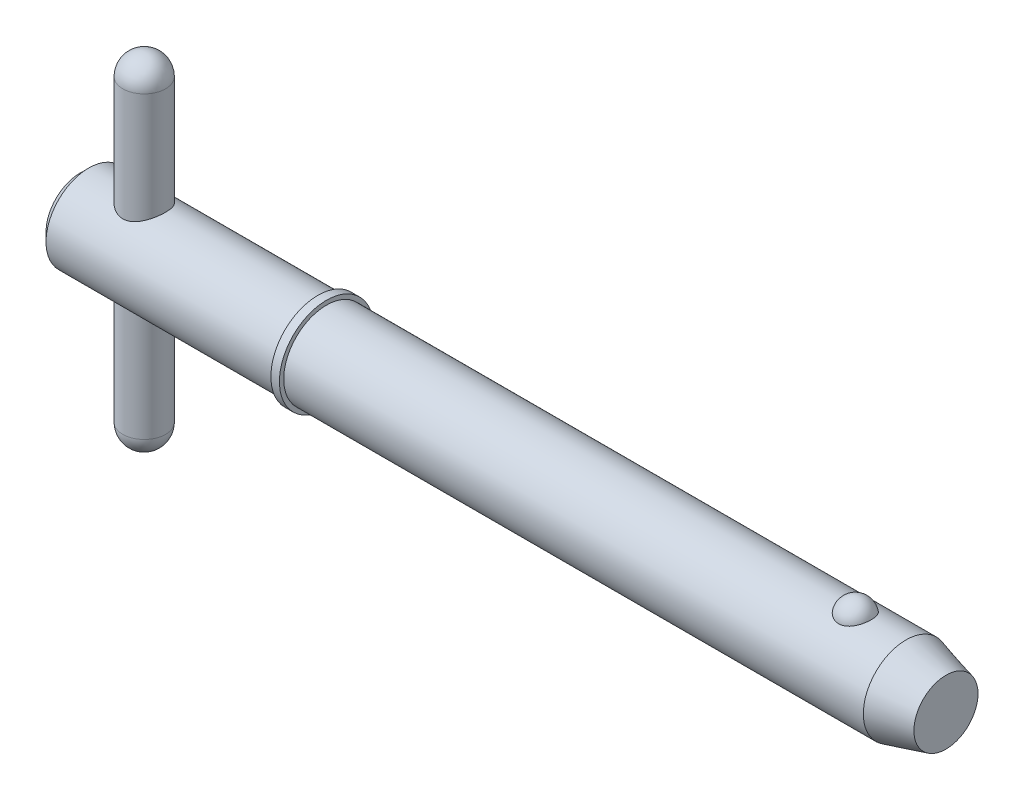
ISO-10303-21;
HEADER;
FILE_DESCRIPTION(('STEP AP214'),'2;1');
FILE_NAME('part.step','',(''),(''),'','','');
FILE_SCHEMA(('AUTOMOTIVE_DESIGN { 1 0 10303 214 1 1 1 1 }'));
ENDSEC;
DATA;
#1=APPLICATION_CONTEXT('core data for automotive mechanical design processes');
#2=APPLICATION_PROTOCOL_DEFINITION('international standard','automotive_design',2000,#1);
#3=PRODUCT_CONTEXT('',#1,'mechanical');
#4=PRODUCT('Part','Part','',(#3));
#5=PRODUCT_RELATED_PRODUCT_CATEGORY('part','',(#4));
#6=PRODUCT_DEFINITION_FORMATION('','',#4);
#7=PRODUCT_DEFINITION_CONTEXT('part definition',#1,'design');
#8=PRODUCT_DEFINITION('design','',#6,#7);
#9=PRODUCT_DEFINITION_SHAPE('','',#8);
#10=(LENGTH_UNIT() NAMED_UNIT(*) SI_UNIT(.MILLI.,.METRE.));
#11=(NAMED_UNIT(*) PLANE_ANGLE_UNIT() SI_UNIT($,.RADIAN.));
#12=(NAMED_UNIT(*) SI_UNIT($,.STERADIAN.) SOLID_ANGLE_UNIT());
#13=UNCERTAINTY_MEASURE_WITH_UNIT(LENGTH_MEASURE(1.E-05),#10,'distance_accuracy_value','');
#14=(GEOMETRIC_REPRESENTATION_CONTEXT(3) GLOBAL_UNCERTAINTY_ASSIGNED_CONTEXT((#13)) GLOBAL_UNIT_ASSIGNED_CONTEXT((#10,
#11,#12)) REPRESENTATION_CONTEXT('',''));
#15=CARTESIAN_POINT('',(0.,0.,0.));
#16=DIRECTION('',(0.,0.,1.));
#17=DIRECTION('',(1.,0.,0.));
#18=AXIS2_PLACEMENT_3D('',#15,#16,#17);
#19=CARTESIAN_POINT('',(4.755,12.7,0.));
#20=DIRECTION('',(0.,-1.,0.));
#21=DIRECTION('',(0.,0.,-1.));
#22=AXIS2_PLACEMENT_3D('',#19,#20,#21);
#23=CYLINDRICAL_SURFACE('',#22,1.585);
#24=CARTESIAN_POINT('',(4.755,-11.115,0.));
#25=DIRECTION('',(0.,-1.,0.));
#26=DIRECTION('',(0.,0.,-1.));
#27=AXIS2_PLACEMENT_3D('',#24,#25,#26);
#28=CIRCLE('',#27,1.585);
#29=CARTESIAN_POINT('',(4.755,-11.115,-1.585));
#30=VERTEX_POINT('',#29);
#31=EDGE_CURVE('P0_E10',#30,#30,#28,.F.);
#32=ORIENTED_EDGE('',*,*,#31,.T.);
#33=EDGE_LOOP('',(#32));
#34=FACE_BOUND('',#33,.T.);
#35=CARTESIAN_POINT('',(4.755,11.115,0.));
#36=DIRECTION('',(0.,-1.,0.));
#37=DIRECTION('',(0.,0.,-1.));
#38=AXIS2_PLACEMENT_3D('',#35,#36,#37);
#39=CIRCLE('',#38,1.585);
#40=CARTESIAN_POINT('',(4.755,11.115,-1.585));
#41=VERTEX_POINT('',#40);
#42=EDGE_CURVE('P0_E21',#41,#41,#39,.T.);
#43=ORIENTED_EDGE('',*,*,#42,.T.);
#44=EDGE_LOOP('',(#43));
#45=FACE_BOUND('',#44,.T.);
#46=ADVANCED_FACE('P0_F14',(#34,#45),#23,.T.);
#47=CARTESIAN_POINT('',(4.755,-11.115,0.));
#48=DIRECTION('',(0.,0.,1.));
#49=DIRECTION('',(1.,0.,0.));
#50=AXIS2_PLACEMENT_3D('',#47,#48,#49);
#51=SPHERICAL_SURFACE('',#50,1.585);
#52=CARTESIAN_POINT('',(4.755,-11.115,0.));
#53=DIRECTION('',(0.,-1.,0.));
#54=DIRECTION('',(0.,0.,-1.));
#55=AXIS2_PLACEMENT_3D('',#52,#53,#54);
#56=SPHERICAL_SURFACE('',#55,1.585);
#57=ORIENTED_EDGE('',*,*,#31,.F.);
#58=EDGE_LOOP('',(#57));
#59=FACE_BOUND('',#58,.T.);
#60=ADVANCED_FACE('P0_F29',(#59),#56,.T.);
#61=CARTESIAN_POINT('',(4.755,11.115,0.));
#62=DIRECTION('',(0.,0.,1.));
#63=DIRECTION('',(1.,0.,0.));
#64=AXIS2_PLACEMENT_3D('',#61,#62,#63);
#65=SPHERICAL_SURFACE('',#64,1.585);
#66=CARTESIAN_POINT('',(4.755,11.115,0.));
#67=DIRECTION('',(0.,-1.,0.));
#68=DIRECTION('',(0.,0.,-1.));
#69=AXIS2_PLACEMENT_3D('',#66,#67,#68);
#70=SPHERICAL_SURFACE('',#69,1.585);
#71=ORIENTED_EDGE('',*,*,#42,.F.);
#72=EDGE_LOOP('',(#71));
#73=FACE_BOUND('',#72,.T.);
#74=ADVANCED_FACE('P0_F16',(#73),#70,.T.);
#75=CLOSED_SHELL('',(#46,#60,#74));
#76=MANIFOLD_SOLID_BREP('P0_B1',#75);
#77=CARTESIAN_POINT('',(0.,0.,0.));
#78=DIRECTION('',(1.,0.,0.));
#79=DIRECTION('',(0.,0.,-1.));
#80=AXIS2_PLACEMENT_3D('',#77,#78,#79);
#81=CYLINDRICAL_SURFACE('',#80,3.175);
#82=CARTESIAN_POINT('',(61.3476846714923,0.,0.));
#83=DIRECTION('',(1.,0.,0.));
#84=DIRECTION('',(0.,0.,-1.));
#85=AXIS2_PLACEMENT_3D('',#82,#83,#84);
#86=CIRCLE('',#85,3.175);
#87=CARTESIAN_POINT('',(61.3476846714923,0.,-3.175));
#88=VERTEX_POINT('',#87);
#89=EDGE_CURVE('P1_E81',#88,#88,#86,.T.);
#90=ORIENTED_EDGE('',*,*,#89,.F.);
#91=EDGE_LOOP('',(#90));
#92=FACE_BOUND('',#91,.T.);
#93=CARTESIAN_POINT('',(18.29,0.,0.));
#94=DIRECTION('',(1.,0.,0.));
#95=DIRECTION('',(0.,0.,-1.));
#96=AXIS2_PLACEMENT_3D('',#93,#94,#95);
#97=CIRCLE('',#96,3.175);
#98=CARTESIAN_POINT('',(18.29,0.,-3.175));
#99=VERTEX_POINT('',#98);
#100=EDGE_CURVE('P1_E85',#99,#99,#97,.T.);
#101=ORIENTED_EDGE('',*,*,#100,.T.);
#102=EDGE_LOOP('',(#101));
#103=FACE_BOUND('',#102,.T.);
#104=CARTESIAN_POINT('',(57.5757276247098,2.92898950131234,1.2254164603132));
#105=CARTESIAN_POINT('',(57.512316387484,2.92899434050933,1.22541146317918));
#106=CARTESIAN_POINT('',(57.4487979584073,2.93112688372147,1.22034641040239));
#107=CARTESIAN_POINT('',(57.3235306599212,2.93942752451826,1.2002094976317));
#108=CARTESIAN_POINT('',(57.2617869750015,2.9456063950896,1.1851109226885));
#109=CARTESIAN_POINT('',(57.1420651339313,2.96127115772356,1.14540352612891));
#110=CARTESIAN_POINT('',(57.0840775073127,2.97074831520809,1.12081980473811));
#111=CARTESIAN_POINT('',(56.9731943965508,2.99197584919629,1.06285154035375));
#112=CARTESIAN_POINT('',(56.9202966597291,3.0037252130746,1.02947091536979));
#113=CARTESIAN_POINT('',(56.8192688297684,3.02865714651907,0.95367409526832));
#114=CARTESIAN_POINT('',(56.771324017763,3.04187163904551,0.911021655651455));
#115=CARTESIAN_POINT('',(56.6830360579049,3.06808741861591,0.818400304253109));
#116=CARTESIAN_POINT('',(56.6426952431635,3.08108863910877,0.768429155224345));
#117=CARTESIAN_POINT('',(56.5688039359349,3.10614903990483,0.660064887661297));
#118=CARTESIAN_POINT('',(56.5356330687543,3.11814104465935,0.601396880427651));
#119=CARTESIAN_POINT('',(56.4791190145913,3.13926931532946,0.47902691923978));
#120=CARTESIAN_POINT('',(56.4557764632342,3.14840539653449,0.415324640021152));
#121=CARTESIAN_POINT('',(56.4191785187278,3.16298160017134,0.283885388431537));
#122=CARTESIAN_POINT('',(56.4060407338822,3.16837855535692,0.21611080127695));
#123=CARTESIAN_POINT('',(56.3905676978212,3.17475386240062,0.0791367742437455));
#124=CARTESIAN_POINT('',(56.388232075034,3.17573236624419,0.00993738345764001));
#125=CARTESIAN_POINT('',(56.3943886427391,3.17318075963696,-0.127420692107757));
#126=CARTESIAN_POINT('',(56.4028073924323,3.16968122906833,-0.195583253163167));
#127=CARTESIAN_POINT('',(56.4301752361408,3.1585790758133,-0.329413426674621));
#128=CARTESIAN_POINT('',(56.4491245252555,3.15097637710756,-0.395080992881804));
#129=CARTESIAN_POINT('',(56.4972057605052,3.13242485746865,-0.522180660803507));
#130=CARTESIAN_POINT('',(56.5263524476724,3.12147119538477,-0.583606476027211));
#131=CARTESIAN_POINT('',(56.5942352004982,3.09734973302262,-0.700436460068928));
#132=CARTESIAN_POINT('',(56.632972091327,3.08418174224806,-0.7558401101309));
#133=CARTESIAN_POINT('',(56.7194771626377,3.05694884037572,-0.859404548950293));
#134=CARTESIAN_POINT('',(56.7672961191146,3.04287919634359,-0.907521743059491));
#135=CARTESIAN_POINT('',(56.8707353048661,3.01548927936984,-0.994758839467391));
#136=CARTESIAN_POINT('',(56.9263549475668,3.0021689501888,-1.03387941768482));
#137=CARTESIAN_POINT('',(57.0428093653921,2.97810316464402,-1.10126594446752));
#138=CARTESIAN_POINT('',(57.1035182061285,2.96731170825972,-1.12973256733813));
#139=CARTESIAN_POINT('',(57.2293712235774,2.94928934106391,-1.17598467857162));
#140=CARTESIAN_POINT('',(57.2945137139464,2.94205708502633,-1.19377420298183));
#141=CARTESIAN_POINT('',(57.4238562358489,2.93233065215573,-1.21746387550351));
#142=CARTESIAN_POINT('',(57.4879385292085,2.92961621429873,-1.22391763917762));
#143=CARTESIAN_POINT('',(57.6163375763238,2.92855752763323,-1.22644976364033));
#144=CARTESIAN_POINT('',(57.6806542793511,2.93021238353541,-1.22253024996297));
#145=CARTESIAN_POINT('',(57.8055239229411,2.93756851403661,-1.20474140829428));
#146=CARTESIAN_POINT('',(57.866131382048,2.94313790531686,-1.1911962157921));
#147=CARTESIAN_POINT('',(57.9841106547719,2.95756226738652,-1.15491492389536));
#148=CARTESIAN_POINT('',(58.0414822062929,2.96641750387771,-1.13217808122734));
#149=CARTESIAN_POINT('',(58.1527699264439,2.98669918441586,-1.07755083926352));
#150=CARTESIAN_POINT('',(58.2065845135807,2.9981771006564,-1.04547308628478));
#151=CARTESIAN_POINT('',(58.3081473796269,3.02240235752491,-0.973220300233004));
#152=CARTESIAN_POINT('',(58.3558942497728,3.03514999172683,-0.933043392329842));
#153=CARTESIAN_POINT('',(58.4465817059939,3.06131230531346,-0.843372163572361));
#154=CARTESIAN_POINT('',(58.4891588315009,3.07472822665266,-0.793510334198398));
#155=CARTESIAN_POINT('',(58.5656765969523,3.10021106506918,-0.687241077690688));
#156=CARTESIAN_POINT('',(58.5996156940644,3.1122777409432,-0.630832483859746));
#157=CARTESIAN_POINT('',(58.6591209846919,3.134208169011,-0.511059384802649));
#158=CARTESIAN_POINT('',(58.6843892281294,3.14399040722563,-0.447531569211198));
#159=CARTESIAN_POINT('',(58.7245117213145,3.15983820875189,-0.316827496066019));
#160=CARTESIAN_POINT('',(58.7393659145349,3.16590375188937,-0.249651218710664));
#161=CARTESIAN_POINT('',(58.758358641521,3.17370076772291,-0.113549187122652));
#162=CARTESIAN_POINT('',(58.7624966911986,3.17543204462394,-0.0446233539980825));
#163=CARTESIAN_POINT('',(58.7599697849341,3.17438372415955,0.0929938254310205));
#164=CARTESIAN_POINT('',(58.7533050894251,3.17160423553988,0.16168517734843));
#165=CARTESIAN_POINT('',(58.7293754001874,3.1618438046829,0.296502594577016));
#166=CARTESIAN_POINT('',(58.7121674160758,3.15488546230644,0.362640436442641));
#167=CARTESIAN_POINT('',(58.667547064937,3.13748892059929,0.490896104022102));
#168=CARTESIAN_POINT('',(58.6401339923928,3.12705048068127,0.553013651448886));
#169=CARTESIAN_POINT('',(58.5754626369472,3.10369139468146,0.671876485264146));
#170=CARTESIAN_POINT('',(58.5381467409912,3.0907563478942,0.728587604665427));
#171=CARTESIAN_POINT('',(58.4545246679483,3.06381731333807,0.834653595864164));
#172=CARTESIAN_POINT('',(58.4082189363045,3.04981337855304,0.884008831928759));
#173=CARTESIAN_POINT('',(58.3077184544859,3.02230423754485,0.973916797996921));
#174=CARTESIAN_POINT('',(58.253535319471,3.00879833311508,1.01448227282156));
#175=CARTESIAN_POINT('',(58.1385299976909,2.98383625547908,1.0857155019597));
#176=CARTESIAN_POINT('',(58.0777053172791,2.9723808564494,1.11637952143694));
#177=CARTESIAN_POINT('',(57.9533690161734,2.95329063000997,1.16592590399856));
#178=CARTESIAN_POINT('',(57.8900230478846,2.9455373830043,1.18517901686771));
#179=CARTESIAN_POINT('',(57.7607664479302,2.9342556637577,1.21284802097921));
#180=CARTESIAN_POINT('',(57.6948641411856,2.93071450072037,1.22129647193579));
#181=CARTESIAN_POINT('',(57.611116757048,2.9291525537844,1.22502505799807));
#182=CARTESIAN_POINT('',(57.5934263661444,2.9289881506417,1.22541785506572));
#183=CARTESIAN_POINT('',(57.5757276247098,2.92898950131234,1.2254164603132));
#184=B_SPLINE_CURVE_WITH_KNOTS('',3,(#104,#105,#106,#107,#108,#109,#110,#111,#112,#113,#114,
#115,#116,#117,#118,#119,#120,#121,#122,#123,#124,#125,#126,#127,#128,#129,#130,#131,#132,#133,
#134,#135,#136,#137,#138,#139,#140,#141,#142,#143,#144,#145,#146,#147,#148,#149,#150,#151,#152,
#153,#154,#155,#156,#157,#158,#159,#160,#161,#162,#163,#164,#165,#166,#167,#168,#169,#170,#171,
#172,#173,#174,#175,#176,#177,#178,#179,#180,#181,#182,#183),.UNSPECIFIED.,.T.,.F.,(4,2,2,2,2,2,
2,2,2,2,2,2,2,2,2,2,2,2,2,2,2,2,2,2,2,2,2,2,2,2,2,2,2,2,2,2,2,2,2,4),(0.,0.190186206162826,
0.380880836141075,0.571074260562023,0.761183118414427,0.95686644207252,1.1526097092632,
1.35701770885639,1.56143892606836,1.76818248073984,1.97491892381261,2.18025109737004,
2.38558707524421,2.59122111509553,2.79687285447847,3.00371012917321,3.21053185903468,
3.41323429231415,3.61586005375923,3.80828192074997,4.00066436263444,4.18685798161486,
4.37306665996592,4.56330302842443,4.75358348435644,4.95345287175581,5.15335793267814,
5.35957003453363,5.56578325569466,5.77200579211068,5.97822335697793,6.18333558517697,
6.38846199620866,6.59480900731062,6.80114579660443,7.0071813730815,7.21329457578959,
7.41228022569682,7.61066481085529,7.66374777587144),.UNSPECIFIED.);
#185=CARTESIAN_POINT('',(57.5757276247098,2.92898950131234,1.2254164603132));
#186=VERTEX_POINT('',#185);
#187=EDGE_CURVE('P1_E35',#186,#186,#184,.T.);
#188=ORIENTED_EDGE('',*,*,#187,.T.);
#189=EDGE_LOOP('',(#188));
#190=FACE_BOUND('',#189,.T.);
#191=ADVANCED_FACE('P1_F13',(#92,#103,#190),#81,.T.);
#192=CARTESIAN_POINT('',(0.,0.,0.));
#193=DIRECTION('',(-1.,0.,0.));
#194=DIRECTION('',(0.,0.,1.));
#195=AXIS2_PLACEMENT_3D('',#192,#193,#194);
#196=PLANE('',#195);
#197=CARTESIAN_POINT('',(0.,0.,0.));
#198=DIRECTION('',(1.,0.,0.));
#199=DIRECTION('',(0.,0.,-1.));
#200=AXIS2_PLACEMENT_3D('',#197,#198,#199);
#201=CIRCLE('',#200,2.54);
#202=CARTESIAN_POINT('',(0.,0.,-2.54));
#203=VERTEX_POINT('',#202);
#204=EDGE_CURVE('P1_E9',#203,#203,#201,.T.);
#205=ORIENTED_EDGE('',*,*,#204,.F.);
#206=EDGE_LOOP('',(#205));
#207=FACE_BOUND('',#206,.T.);
#208=ADVANCED_FACE('P1_F15',(#207),#196,.T.);
#209=CARTESIAN_POINT('',(0.634999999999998,0.,0.));
#210=DIRECTION('',(1.,0.,0.));
#211=DIRECTION('',(0.,0.,-1.));
#212=AXIS2_PLACEMENT_3D('',#209,#210,#211);
#213=CONICAL_SURFACE('',#212,3.175,0.78539816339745);
#214=ORIENTED_EDGE('',*,*,#204,.T.);
#215=EDGE_LOOP('',(#214));
#216=FACE_BOUND('',#215,.T.);
#217=CARTESIAN_POINT('',(0.634999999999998,0.,0.));
#218=DIRECTION('',(1.,0.,0.));
#219=DIRECTION('',(0.,0.,-1.));
#220=AXIS2_PLACEMENT_3D('',#217,#218,#219);
#221=CIRCLE('',#220,3.175);
#222=CARTESIAN_POINT('',(0.634999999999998,0.,-3.175));
#223=VERTEX_POINT('',#222);
#224=EDGE_CURVE('P1_E26',#223,#223,#221,.T.);
#225=ORIENTED_EDGE('',*,*,#224,.F.);
#226=EDGE_LOOP('',(#225));
#227=FACE_BOUND('',#226,.T.);
#228=ADVANCED_FACE('P1_F77',(#216,#227),#213,.T.);
#229=CARTESIAN_POINT('',(0.,0.,0.));
#230=DIRECTION('',(1.,0.,0.));
#231=DIRECTION('',(0.,0.,-1.));
#232=AXIS2_PLACEMENT_3D('',#229,#230,#231);
#233=CYLINDRICAL_SURFACE('',#232,3.175);
#234=CARTESIAN_POINT('',(4.755,-2.75107251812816,1.585));
#235=CARTESIAN_POINT('',(4.67238891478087,-2.7510796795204,1.58499425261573));
#236=CARTESIAN_POINT('',(4.58967306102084,-2.75485010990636,1.57849830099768));
#237=CARTESIAN_POINT('',(4.42677850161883,-2.76938647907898,1.55284486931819));
#238=CARTESIAN_POINT('',(4.34660551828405,-2.78016716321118,1.53366069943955));
#239=CARTESIAN_POINT('',(4.19146029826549,-2.80716278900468,1.48366329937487));
#240=CARTESIAN_POINT('',(4.11646293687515,-2.8233488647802,1.45291173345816));
#241=CARTESIAN_POINT('',(3.97271079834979,-2.85928672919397,1.38084067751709));
#242=CARTESIAN_POINT('',(3.90395634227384,-2.87903870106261,1.33952064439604));
#243=CARTESIAN_POINT('',(3.76839976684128,-2.921867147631,1.24350234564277));
#244=CARTESIAN_POINT('',(3.702222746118,-2.94508343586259,1.18798355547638));
#245=CARTESIAN_POINT('',(3.5796334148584,-2.99109588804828,1.06685014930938));
#246=CARTESIAN_POINT('',(3.52322596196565,-3.01389183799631,1.00123054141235));
#247=CARTESIAN_POINT('',(3.41807024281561,-3.05832598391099,0.856373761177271));
#248=CARTESIAN_POINT('',(3.37009053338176,-3.07978367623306,0.776518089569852));
#249=CARTESIAN_POINT('',(3.28853137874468,-3.11730894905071,0.608596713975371));
#250=CARTESIAN_POINT('',(3.25494287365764,-3.1333799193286,0.520536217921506));
#251=CARTESIAN_POINT('',(3.20559401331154,-3.15731341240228,0.345327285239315));
#252=CARTESIAN_POINT('',(3.18873760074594,-3.16567752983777,0.258557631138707));
#253=CARTESIAN_POINT('',(3.16972238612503,-3.17512718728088,0.0830496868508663));
#254=CARTESIAN_POINT('',(3.16755472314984,-3.17621711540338,-0.00568738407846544));
#255=CARTESIAN_POINT('',(3.1775542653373,-3.17123385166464,-0.174372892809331));
#256=CARTESIAN_POINT('',(3.18849502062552,-3.16577346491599,-0.254416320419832));
#257=CARTESIAN_POINT('',(3.22220680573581,-3.14922844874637,-0.411354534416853));
#258=CARTESIAN_POINT('',(3.2449787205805,-3.13814339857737,-0.488249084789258));
#259=CARTESIAN_POINT('',(3.30185558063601,-3.111172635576,-0.638050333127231));
#260=CARTESIAN_POINT('',(3.33611332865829,-3.09522247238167,-0.710886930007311));
#261=CARTESIAN_POINT('',(3.41477890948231,-3.05996035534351,-0.849953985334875));
#262=CARTESIAN_POINT('',(3.45919037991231,-3.04064719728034,-0.916182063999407));
#263=CARTESIAN_POINT('',(3.5617148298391,-2.99832415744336,-1.04681642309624));
#264=CARTESIAN_POINT('',(3.62072497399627,-2.97513741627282,-1.11046186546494));
#265=CARTESIAN_POINT('',(3.7483697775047,-2.92885066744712,-1.22736291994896));
#266=CARTESIAN_POINT('',(3.81701173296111,-2.90575073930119,-1.2806105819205));
#267=CARTESIAN_POINT('',(3.96727993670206,-2.86067370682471,-1.37849835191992));
#268=CARTESIAN_POINT('',(4.04945242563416,-2.83885964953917,-1.42238246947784));
#269=CARTESIAN_POINT('',(4.2213558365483,-2.80110454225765,-1.49537418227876));
#270=CARTESIAN_POINT('',(4.3110787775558,-2.78515738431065,-1.52449715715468));
#271=CARTESIAN_POINT('',(4.48806324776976,-2.76271292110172,-1.56478065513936));
#272=CARTESIAN_POINT('',(4.57495732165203,-2.75556745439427,-1.57718067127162));
#273=CARTESIAN_POINT('',(4.74985771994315,-2.74969306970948,-1.58740564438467));
#274=CARTESIAN_POINT('',(4.8378632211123,-2.75095824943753,-1.58524082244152));
#275=CARTESIAN_POINT('',(5.00227282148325,-2.76107477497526,-1.56753530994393));
#276=CARTESIAN_POINT('',(5.07889680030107,-2.76908515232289,-1.55347662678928));
#277=CARTESIAN_POINT('',(5.22855309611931,-2.79054849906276,-1.51458035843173));
#278=CARTESIAN_POINT('',(5.30158424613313,-2.80400322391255,-1.489739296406));
#279=CARTESIAN_POINT('',(5.44583114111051,-2.83556995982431,-1.42877335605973));
#280=CARTESIAN_POINT('',(5.51680600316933,-2.85386886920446,-1.39217900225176));
#281=CARTESIAN_POINT('',(5.6520174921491,-2.89289503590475,-1.30915485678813));
#282=CARTESIAN_POINT('',(5.71625063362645,-2.91362353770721,-1.26272001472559));
#283=CARTESIAN_POINT('',(5.8445938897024,-2.95830220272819,-1.15451693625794));
#284=CARTESIAN_POINT('',(5.90767560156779,-2.98233004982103,-1.09155543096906));
#285=CARTESIAN_POINT('',(6.0226995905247,-3.02864458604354,-0.955560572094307));
#286=CARTESIAN_POINT('',(6.07463814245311,-3.05093069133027,-0.882523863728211));
#287=CARTESIAN_POINT('',(6.16704288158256,-3.09200671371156,-0.725836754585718));
#288=CARTESIAN_POINT('',(6.20717458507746,-3.11069030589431,-0.64195924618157));
#289=CARTESIAN_POINT('',(6.27235859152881,-3.1416474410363,-0.467442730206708));
#290=CARTESIAN_POINT('',(6.29742409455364,-3.15392659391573,-0.376809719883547));
#291=CARTESIAN_POINT('',(6.32960989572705,-3.16979844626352,-0.200314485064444));
#292=CARTESIAN_POINT('',(6.33816324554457,-3.17408359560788,-0.114775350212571));
#293=CARTESIAN_POINT('',(6.34130309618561,-3.17565001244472,0.0566108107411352));
#294=CARTESIAN_POINT('',(6.33589445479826,-3.17293371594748,0.142457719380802));
#295=CARTESIAN_POINT('',(6.31221457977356,-3.16120608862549,0.306097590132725));
#296=CARTESIAN_POINT('',(6.2948097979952,-3.15261910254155,0.38404960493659));
#297=CARTESIAN_POINT('',(6.24879775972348,-3.13040364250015,0.535801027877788));
#298=CARTESIAN_POINT('',(6.22018889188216,-3.11677444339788,0.609599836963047));
#299=CARTESIAN_POINT('',(6.15130303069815,-3.08497808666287,0.754502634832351));
#300=CARTESIAN_POINT('',(6.11057850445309,-3.0666414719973,0.82535556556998));
#301=CARTESIAN_POINT('',(6.01917980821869,-3.02735012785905,0.95951596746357));
#302=CARTESIAN_POINT('',(5.96850106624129,-3.00639419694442,1.02281994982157));
#303=CARTESIAN_POINT('',(5.8528006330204,-2.96149402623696,1.1467073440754));
#304=CARTESIAN_POINT('',(5.78685463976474,-2.93745961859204,1.20639723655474));
#305=CARTESIAN_POINT('',(5.64552278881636,-2.89084502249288,1.31419099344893));
#306=CARTESIAN_POINT('',(5.57012871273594,-2.8682661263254,1.36228466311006));
#307=CARTESIAN_POINT('',(5.40892145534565,-2.82661780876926,1.44677201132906));
#308=CARTESIAN_POINT('',(5.32285703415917,-2.80767948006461,1.48275497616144));
#309=CARTESIAN_POINT('',(5.14469010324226,-2.77716572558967,1.53916557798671));
#310=CARTESIAN_POINT('',(5.05260892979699,-2.76556569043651,1.55964525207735));
#311=CARTESIAN_POINT('',(4.92544162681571,-2.75613775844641,1.57618070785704));
#312=CARTESIAN_POINT('',(4.89147210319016,-2.75424493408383,1.57948285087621));
#313=CARTESIAN_POINT('',(4.82334103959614,-2.75171079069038,1.58389375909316));
#314=CARTESIAN_POINT('',(4.78917948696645,-2.75106955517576,1.58500237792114));
#315=CARTESIAN_POINT('',(4.755,-2.75107251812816,1.585));
#316=B_SPLINE_CURVE_WITH_KNOTS('',3,(#234,#235,#236,#237,#238,#239,#240,#241,#242,#243,#244,
#245,#246,#247,#248,#249,#250,#251,#252,#253,#254,#255,#256,#257,#258,#259,#260,#261,#262,#263,
#264,#265,#266,#267,#268,#269,#270,#271,#272,#273,#274,#275,#276,#277,#278,#279,#280,#281,#282,
#283,#284,#285,#286,#287,#288,#289,#290,#291,#292,#293,#294,#295,#296,#297,#298,#299,#300,#301,
#302,#303,#304,#305,#306,#307,#308,#309,#310,#311,#312,#313,#314,#315),.UNSPECIFIED.,.T.,.F.,(4,
2,2,2,2,2,2,2,2,2,2,2,2,2,2,2,2,2,2,2,2,2,2,2,2,2,2,2,2,2,2,2,2,2,2,2,2,2,2,2,4),(0.,
0.247689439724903,0.495901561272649,0.742808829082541,0.989728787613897,1.25694656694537,
1.52429683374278,1.80959781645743,2.0947189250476,2.35960564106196,2.62433255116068,
2.86610932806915,3.1079041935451,3.35305262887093,3.59828902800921,3.86665310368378,
4.13522157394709,4.4207514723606,4.70598326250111,4.9686344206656,5.23110127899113,
5.46499114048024,5.69895647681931,5.94376186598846,6.1886932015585,6.46438263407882,
6.74016408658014,7.0231370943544,7.30586181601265,7.5626977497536,7.81944433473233,
8.05935987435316,8.29930993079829,8.54954401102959,8.79989329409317,9.07508848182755,
9.35052473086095,9.63453318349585,9.91758407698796,10.0200561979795,10.1225351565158),.UNSPECIFIED.);
#317=CARTESIAN_POINT('',(4.755,-2.75107251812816,1.585));
#318=VERTEX_POINT('',#317);
#319=EDGE_CURVE('P1_E17',#318,#318,#316,.T.);
#320=ORIENTED_EDGE('',*,*,#319,.F.);
#321=EDGE_LOOP('',(#320));
#322=FACE_BOUND('',#321,.T.);
#323=CARTESIAN_POINT('',(4.755,2.75107251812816,1.585));
#324=CARTESIAN_POINT('',(4.83761108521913,2.7510796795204,1.58499425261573));
#325=CARTESIAN_POINT('',(4.92032693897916,2.75485010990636,1.57849830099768));
#326=CARTESIAN_POINT('',(5.08322149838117,2.76938647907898,1.55284486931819));
#327=CARTESIAN_POINT('',(5.16339448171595,2.78016716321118,1.53366069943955));
#328=CARTESIAN_POINT('',(5.31853970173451,2.80716278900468,1.48366329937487));
#329=CARTESIAN_POINT('',(5.39353706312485,2.8233488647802,1.45291173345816));
#330=CARTESIAN_POINT('',(5.53728920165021,2.85928672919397,1.38084067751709));
#331=CARTESIAN_POINT('',(5.60604365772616,2.87903870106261,1.33952064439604));
#332=CARTESIAN_POINT('',(5.74160023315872,2.921867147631,1.24350234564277));
#333=CARTESIAN_POINT('',(5.807777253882,2.94508343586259,1.18798355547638));
#334=CARTESIAN_POINT('',(5.9303665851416,2.99109588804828,1.06685014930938));
#335=CARTESIAN_POINT('',(5.98677403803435,3.01389183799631,1.00123054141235));
#336=CARTESIAN_POINT('',(6.09192975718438,3.05832598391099,0.85637376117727));
#337=CARTESIAN_POINT('',(6.13990946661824,3.07978367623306,0.776518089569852));
#338=CARTESIAN_POINT('',(6.22146862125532,3.11730894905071,0.608596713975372));
#339=CARTESIAN_POINT('',(6.25505712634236,3.1333799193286,0.520536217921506));
#340=CARTESIAN_POINT('',(6.30440598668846,3.15731341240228,0.345327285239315));
#341=CARTESIAN_POINT('',(6.32126239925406,3.16567752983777,0.258557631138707));
#342=CARTESIAN_POINT('',(6.34027761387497,3.17512718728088,0.0830496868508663));
#343=CARTESIAN_POINT('',(6.34244527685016,3.17621711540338,-0.00568738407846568));
#344=CARTESIAN_POINT('',(6.3324457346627,3.17123385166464,-0.174372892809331));
#345=CARTESIAN_POINT('',(6.32150497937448,3.16577346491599,-0.254416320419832));
#346=CARTESIAN_POINT('',(6.28779319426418,3.14922844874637,-0.411354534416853));
#347=CARTESIAN_POINT('',(6.2650212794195,3.13814339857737,-0.488249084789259));
#348=CARTESIAN_POINT('',(6.20814441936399,3.111172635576,-0.638050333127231));
#349=CARTESIAN_POINT('',(6.17388667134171,3.09522247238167,-0.710886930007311));
#350=CARTESIAN_POINT('',(6.09522109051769,3.05996035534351,-0.849953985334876));
#351=CARTESIAN_POINT('',(6.05080962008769,3.04064719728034,-0.916182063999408));
#352=CARTESIAN_POINT('',(5.9482851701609,2.99832415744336,-1.04681642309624));
#353=CARTESIAN_POINT('',(5.88927502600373,2.97513741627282,-1.11046186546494));
#354=CARTESIAN_POINT('',(5.7616302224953,2.92885066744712,-1.22736291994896));
#355=CARTESIAN_POINT('',(5.69298826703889,2.90575073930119,-1.2806105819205));
#356=CARTESIAN_POINT('',(5.54272006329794,2.86067370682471,-1.37849835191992));
#357=CARTESIAN_POINT('',(5.46054757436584,2.83885964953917,-1.42238246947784));
#358=CARTESIAN_POINT('',(5.2886441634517,2.80110454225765,-1.49537418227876));
#359=CARTESIAN_POINT('',(5.19892122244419,2.78515738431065,-1.52449715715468));
#360=CARTESIAN_POINT('',(5.02193675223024,2.76271292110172,-1.56478065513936));
#361=CARTESIAN_POINT('',(4.93504267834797,2.75556745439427,-1.57718067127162));
#362=CARTESIAN_POINT('',(4.76014228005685,2.74969306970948,-1.58740564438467));
#363=CARTESIAN_POINT('',(4.6721367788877,2.75095824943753,-1.58524082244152));
#364=CARTESIAN_POINT('',(4.50772717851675,2.76107477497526,-1.56753530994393));
#365=CARTESIAN_POINT('',(4.43110319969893,2.76908515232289,-1.55347662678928));
#366=CARTESIAN_POINT('',(4.28144690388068,2.79054849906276,-1.51458035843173));
#367=CARTESIAN_POINT('',(4.20841575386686,2.80400322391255,-1.489739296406));
#368=CARTESIAN_POINT('',(4.06416885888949,2.83556995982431,-1.42877335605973));
#369=CARTESIAN_POINT('',(3.99319399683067,2.85386886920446,-1.39217900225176));
#370=CARTESIAN_POINT('',(3.8579825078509,2.89289503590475,-1.30915485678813));
#371=CARTESIAN_POINT('',(3.79374936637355,2.91362353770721,-1.26272001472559));
#372=CARTESIAN_POINT('',(3.6654061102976,2.95830220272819,-1.15451693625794));
#373=CARTESIAN_POINT('',(3.60232439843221,2.98233004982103,-1.09155543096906));
#374=CARTESIAN_POINT('',(3.4873004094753,3.02864458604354,-0.955560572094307));
#375=CARTESIAN_POINT('',(3.43536185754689,3.05093069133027,-0.88252386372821));
#376=CARTESIAN_POINT('',(3.34295711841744,3.09200671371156,-0.725836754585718));
#377=CARTESIAN_POINT('',(3.30282541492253,3.11069030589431,-0.64195924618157));
#378=CARTESIAN_POINT('',(3.23764140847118,3.14164744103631,-0.467442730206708));
#379=CARTESIAN_POINT('',(3.21257590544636,3.15392659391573,-0.376809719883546));
#380=CARTESIAN_POINT('',(3.18039010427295,3.16979844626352,-0.200314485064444));
#381=CARTESIAN_POINT('',(3.17183675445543,3.17408359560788,-0.114775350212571));
#382=CARTESIAN_POINT('',(3.16869690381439,3.17565001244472,0.0566108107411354));
#383=CARTESIAN_POINT('',(3.17410554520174,3.17293371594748,0.142457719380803));
#384=CARTESIAN_POINT('',(3.19778542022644,3.16120608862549,0.306097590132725));
#385=CARTESIAN_POINT('',(3.2151902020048,3.15261910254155,0.384049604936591));
#386=CARTESIAN_POINT('',(3.26120224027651,3.13040364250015,0.535801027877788));
#387=CARTESIAN_POINT('',(3.28981110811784,3.11677444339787,0.609599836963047));
#388=CARTESIAN_POINT('',(3.35869696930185,3.08497808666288,0.754502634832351));
#389=CARTESIAN_POINT('',(3.39942149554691,3.0666414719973,0.82535556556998));
#390=CARTESIAN_POINT('',(3.49082019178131,3.02735012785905,0.95951596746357));
#391=CARTESIAN_POINT('',(3.54149893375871,3.00639419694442,1.02281994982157));
#392=CARTESIAN_POINT('',(3.6571993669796,2.96149402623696,1.1467073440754));
#393=CARTESIAN_POINT('',(3.72314536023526,2.93745961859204,1.20639723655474));
#394=CARTESIAN_POINT('',(3.86447721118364,2.89084502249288,1.31419099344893));
#395=CARTESIAN_POINT('',(3.93987128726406,2.8682661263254,1.36228466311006));
#396=CARTESIAN_POINT('',(4.10107854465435,2.82661780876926,1.44677201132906));
#397=CARTESIAN_POINT('',(4.18714296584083,2.80767948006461,1.48275497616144));
#398=CARTESIAN_POINT('',(4.36530989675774,2.77716572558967,1.53916557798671));
#399=CARTESIAN_POINT('',(4.45739107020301,2.76556569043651,1.55964525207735));
#400=CARTESIAN_POINT('',(4.58455837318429,2.75613775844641,1.57618070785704));
#401=CARTESIAN_POINT('',(4.61852789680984,2.75424493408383,1.57948285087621));
#402=CARTESIAN_POINT('',(4.68665896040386,2.75171079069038,1.58389375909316));
#403=CARTESIAN_POINT('',(4.72082051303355,2.75106955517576,1.58500237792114));
#404=CARTESIAN_POINT('',(4.755,2.75107251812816,1.585));
#405=B_SPLINE_CURVE_WITH_KNOTS('',3,(#323,#324,#325,#326,#327,#328,#329,#330,#331,#332,#333,
#334,#335,#336,#337,#338,#339,#340,#341,#342,#343,#344,#345,#346,#347,#348,#349,#350,#351,#352,
#353,#354,#355,#356,#357,#358,#359,#360,#361,#362,#363,#364,#365,#366,#367,#368,#369,#370,#371,
#372,#373,#374,#375,#376,#377,#378,#379,#380,#381,#382,#383,#384,#385,#386,#387,#388,#389,#390,
#391,#392,#393,#394,#395,#396,#397,#398,#399,#400,#401,#402,#403,#404),.UNSPECIFIED.,.T.,.F.,(4,
2,2,2,2,2,2,2,2,2,2,2,2,2,2,2,2,2,2,2,2,2,2,2,2,2,2,2,2,2,2,2,2,2,2,2,2,2,2,2,4),(0.,
0.247689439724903,0.495901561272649,0.742808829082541,0.989728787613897,1.25694656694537,
1.52429683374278,1.80959781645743,2.0947189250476,2.35960564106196,2.62433255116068,
2.86610932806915,3.1079041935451,3.35305262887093,3.59828902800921,3.86665310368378,
4.13522157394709,4.4207514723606,4.70598326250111,4.9686344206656,5.23110127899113,
5.46499114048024,5.69895647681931,5.94376186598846,6.1886932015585,6.46438263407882,
6.74016408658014,7.0231370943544,7.30586181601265,7.5626977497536,7.81944433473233,
8.05935987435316,8.29930993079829,8.54954401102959,8.79989329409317,9.07508848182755,
9.35052473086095,9.63453318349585,9.91758407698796,10.0200561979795,10.1225351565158),.UNSPECIFIED.);
#406=CARTESIAN_POINT('',(4.755,2.75107251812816,1.585));
#407=VERTEX_POINT('',#406);
#408=EDGE_CURVE('P1_E43',#407,#407,#405,.T.);
#409=ORIENTED_EDGE('',*,*,#408,.F.);
#410=EDGE_LOOP('',(#409));
#411=FACE_BOUND('',#410,.T.);
#412=ORIENTED_EDGE('',*,*,#224,.T.);
#413=EDGE_LOOP('',(#412));
#414=FACE_BOUND('',#413,.T.);
#415=CARTESIAN_POINT('',(17.655,0.,0.));
#416=DIRECTION('',(1.,0.,0.));
#417=DIRECTION('',(0.,0.,-1.));
#418=AXIS2_PLACEMENT_3D('',#415,#416,#417);
#419=CIRCLE('',#418,3.175);
#420=CARTESIAN_POINT('',(17.655,0.,-3.175));
#421=VERTEX_POINT('',#420);
#422=EDGE_CURVE('P1_E31',#421,#421,#419,.T.);
#423=ORIENTED_EDGE('',*,*,#422,.F.);
#424=EDGE_LOOP('',(#423));
#425=FACE_BOUND('',#424,.T.);
#426=ADVANCED_FACE('P1_F103',(#322,#411,#414,#425),#233,.T.);
#427=CARTESIAN_POINT('',(17.655,3.175,0.));
#428=DIRECTION('',(-1.,0.,0.));
#429=DIRECTION('',(0.,0.,1.));
#430=AXIS2_PLACEMENT_3D('',#427,#428,#429);
#431=PLANE('',#430);
#432=ORIENTED_EDGE('',*,*,#422,.T.);
#433=EDGE_LOOP('',(#432));
#434=FACE_BOUND('',#433,.T.);
#435=CARTESIAN_POINT('',(17.655,0.,0.));
#436=DIRECTION('',(1.,0.,0.));
#437=DIRECTION('',(0.,0.,-1.));
#438=AXIS2_PLACEMENT_3D('',#435,#436,#437);
#439=CIRCLE('',#438,3.4925);
#440=CARTESIAN_POINT('',(17.655,0.,-3.4925));
#441=VERTEX_POINT('',#440);
#442=EDGE_CURVE('P1_E91',#441,#441,#439,.T.);
#443=ORIENTED_EDGE('',*,*,#442,.F.);
#444=EDGE_LOOP('',(#443));
#445=FACE_BOUND('',#444,.T.);
#446=ADVANCED_FACE('P1_F100',(#434,#445),#431,.T.);
#447=CARTESIAN_POINT('',(0.,0.,0.));
#448=DIRECTION('',(1.,0.,0.));
#449=DIRECTION('',(0.,0.,-1.));
#450=AXIS2_PLACEMENT_3D('',#447,#448,#449);
#451=CYLINDRICAL_SURFACE('',#450,3.4925);
#452=ORIENTED_EDGE('',*,*,#442,.T.);
#453=EDGE_LOOP('',(#452));
#454=FACE_BOUND('',#453,.T.);
#455=CARTESIAN_POINT('',(18.29,0.,0.));
#456=DIRECTION('',(1.,0.,0.));
#457=DIRECTION('',(0.,0.,-1.));
#458=AXIS2_PLACEMENT_3D('',#455,#456,#457);
#459=CIRCLE('',#458,3.4925);
#460=CARTESIAN_POINT('',(18.29,0.,-3.4925));
#461=VERTEX_POINT('',#460);
#462=EDGE_CURVE('P1_E88',#461,#461,#459,.T.);
#463=ORIENTED_EDGE('',*,*,#462,.F.);
#464=EDGE_LOOP('',(#463));
#465=FACE_BOUND('',#464,.T.);
#466=ADVANCED_FACE('P1_F68',(#454,#465),#451,.T.);
#467=CARTESIAN_POINT('',(18.29,3.4925,0.));
#468=DIRECTION('',(1.,0.,0.));
#469=DIRECTION('',(0.,0.,-1.));
#470=AXIS2_PLACEMENT_3D('',#467,#468,#469);
#471=PLANE('',#470);
#472=ORIENTED_EDGE('',*,*,#462,.T.);
#473=EDGE_LOOP('',(#472));
#474=FACE_BOUND('',#473,.T.);
#475=ORIENTED_EDGE('',*,*,#100,.F.);
#476=EDGE_LOOP('',(#475));
#477=FACE_BOUND('',#476,.T.);
#478=ADVANCED_FACE('P1_F62',(#474,#477),#471,.T.);
#479=CARTESIAN_POINT('',(64.31,0.,0.));
#480=DIRECTION('',(-1.,0.,0.));
#481=DIRECTION('',(0.,0.,1.));
#482=AXIS2_PLACEMENT_3D('',#479,#480,#481);
#483=CONICAL_SURFACE('',#482,2.38125000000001,0.26179938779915);
#484=ORIENTED_EDGE('',*,*,#89,.T.);
#485=EDGE_LOOP('',(#484));
#486=FACE_BOUND('',#485,.T.);
#487=CARTESIAN_POINT('',(64.31,0.,0.));
#488=DIRECTION('',(1.,0.,0.));
#489=DIRECTION('',(0.,0.,-1.));
#490=AXIS2_PLACEMENT_3D('',#487,#488,#489);
#491=CIRCLE('',#490,2.38125000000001);
#492=CARTESIAN_POINT('',(64.31,0.,-2.38125000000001));
#493=VERTEX_POINT('',#492);
#494=EDGE_CURVE('P1_E42',#493,#493,#491,.T.);
#495=ORIENTED_EDGE('',*,*,#494,.F.);
#496=EDGE_LOOP('',(#495));
#497=FACE_BOUND('',#496,.T.);
#498=ADVANCED_FACE('P1_F59',(#486,#497),#483,.T.);
#499=CARTESIAN_POINT('',(64.31,2.38125000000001,0.));
#500=DIRECTION('',(1.,0.,0.));
#501=DIRECTION('',(0.,0.,-1.));
#502=AXIS2_PLACEMENT_3D('',#499,#500,#501);
#503=PLANE('',#502);
#504=ORIENTED_EDGE('',*,*,#494,.T.);
#505=EDGE_LOOP('',(#504));
#506=FACE_BOUND('',#505,.T.);
#507=ADVANCED_FACE('P1_F55',(#506),#503,.T.);
#508=CARTESIAN_POINT('',(57.5757276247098,2.8575,0.));
#509=DIRECTION('',(-1.,0.,0.));
#510=DIRECTION('',(0.,1.,0.));
#511=AXIS2_PLACEMENT_3D('',#508,#509,#510);
#512=SPHERICAL_SURFACE('',#511,1.2275);
#513=ORIENTED_EDGE('',*,*,#187,.F.);
#514=EDGE_LOOP('',(#513));
#515=FACE_BOUND('',#514,.T.);
#516=ADVANCED_FACE('P1_F50',(#515),#512,.T.);
#517=CARTESIAN_POINT('',(4.755,-3.4925,0.));
#518=DIRECTION('',(0.,1.,0.));
#519=DIRECTION('',(0.,0.,1.));
#520=AXIS2_PLACEMENT_3D('',#517,#518,#519);
#521=CYLINDRICAL_SURFACE('',#520,1.585);
#522=ORIENTED_EDGE('',*,*,#319,.T.);
#523=EDGE_LOOP('',(#522));
#524=FACE_BOUND('',#523,.T.);
#525=ORIENTED_EDGE('',*,*,#408,.T.);
#526=EDGE_LOOP('',(#525));
#527=FACE_BOUND('',#526,.T.);
#528=ADVANCED_FACE('P1_F54',(#524,#527),#521,.F.);
#529=CLOSED_SHELL('',(#191,#208,#228,#426,#446,#466,#478,#498,#507,#516,#528));
#530=MANIFOLD_SOLID_BREP('P1_B1',#529);
#531=ADVANCED_BREP_SHAPE_REPRESENTATION('',(#18,#76,#530),#14);
#532=SHAPE_DEFINITION_REPRESENTATION(#9,#531);
ENDSEC;
END-ISO-10303-21;
